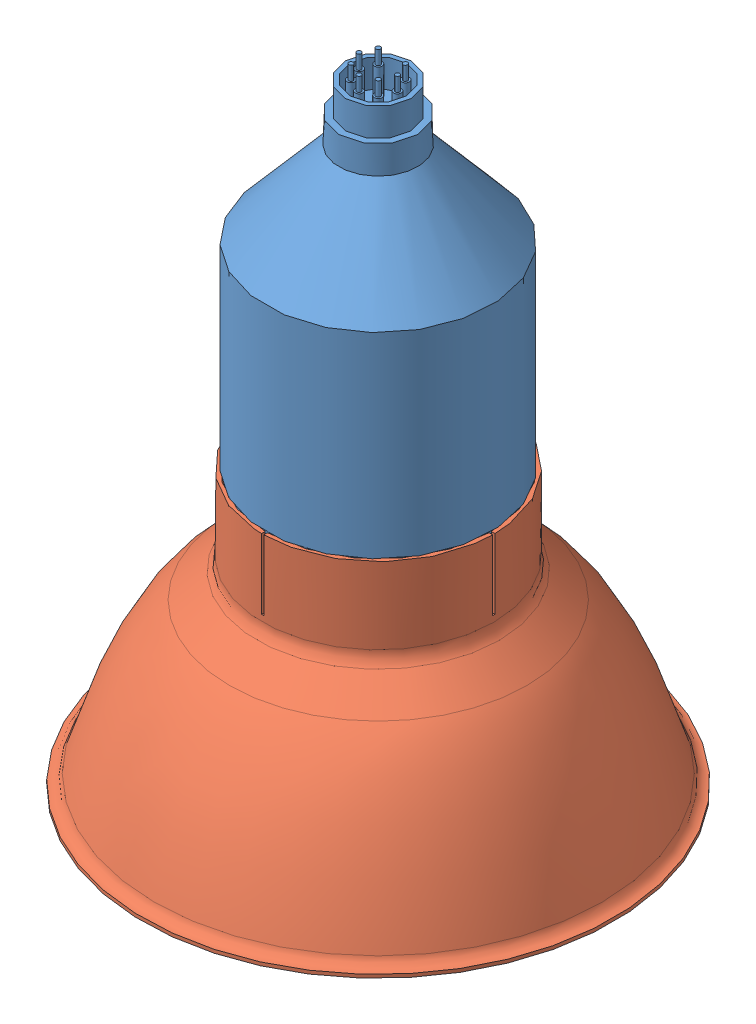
SolidWorks assembly AquaFlash_Strobe_Assy_V2.SLDASM, configuration Default (file format 17000). Lengths in mm.
Overall size (370.18 288.93 1081.21).
2 component instances, 2 part files, 4 mates.
Components (placement in the parent):
- AquaFlash-1: AquaFlash.SLDPRT [Default] at (290.8633 146.558 -974.7604) size (101.6 288.93 101.6)
- AquaFlash_Reflector-1: AquaFlash_Reflector.sldprt [Default] at (290.8633 11.1755 -974.7604) size (212.8 125.5 212.8)
Mates (geometry in assembly coordinates):
- Coincident20: coincident: plane of ? through (63.0754 211.9533 0) normal (0.309017 0.951057 0); plane of ? through (63.0754 211.9533 0) normal (-0.309017 -0.951057 0)
- Concentric33: concentric: cylinder of ? through (65.5479 219.5627 0) axis (0.309017 0.951057 0) radius 44.45; cylinder of ? through (61.1132 205.9141 0) axis (0.309017 0.951057 0) radius 36.83
- Concentric35: concentric aligned: cylinder of AquaFlash-1 through (290.8633 146.558 -974.7604) axis (0 1 0) radius 49.784; cylinder of AquaFlash_Reflector-1 through (290.8633 11.1755 -974.7604) axis (0 1 0) radius 50.8
- Coincident75: coincident anti-aligned: plane of AquaFlash-1 through (340.6473 38.354 -974.7604) normal (0 -1 0); plane of AquaFlash_Reflector-1 through (341.6633 38.354 -974.7604) normal (0 1 0)
